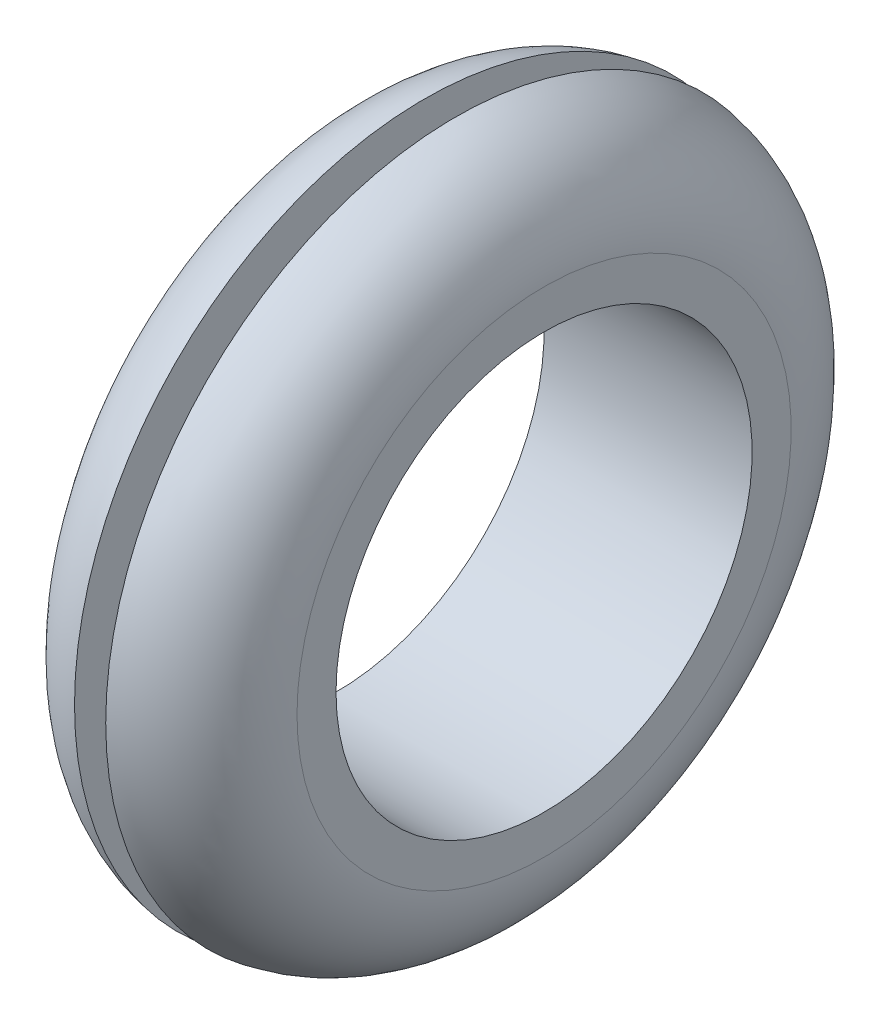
ISO-10303-21;
HEADER;
FILE_DESCRIPTION(('STEP AP214'),'2;1');
FILE_NAME('part.step','',(''),(''),'','','');
FILE_SCHEMA(('AUTOMOTIVE_DESIGN { 1 0 10303 214 1 1 1 1 }'));
ENDSEC;
DATA;
#1=APPLICATION_CONTEXT('core data for automotive mechanical design processes');
#2=APPLICATION_PROTOCOL_DEFINITION('international standard','automotive_design',2000,#1);
#3=PRODUCT_CONTEXT('',#1,'mechanical');
#4=PRODUCT('Part','Part','',(#3));
#5=PRODUCT_RELATED_PRODUCT_CATEGORY('part','',(#4));
#6=PRODUCT_DEFINITION_FORMATION('','',#4);
#7=PRODUCT_DEFINITION_CONTEXT('part definition',#1,'design');
#8=PRODUCT_DEFINITION('design','',#6,#7);
#9=PRODUCT_DEFINITION_SHAPE('','',#8);
#10=(LENGTH_UNIT() NAMED_UNIT(*) SI_UNIT(.MILLI.,.METRE.));
#11=(NAMED_UNIT(*) PLANE_ANGLE_UNIT() SI_UNIT($,.RADIAN.));
#12=(NAMED_UNIT(*) SI_UNIT($,.STERADIAN.) SOLID_ANGLE_UNIT());
#13=UNCERTAINTY_MEASURE_WITH_UNIT(LENGTH_MEASURE(1.E-05),#10,'distance_accuracy_value','');
#14=(GEOMETRIC_REPRESENTATION_CONTEXT(3) GLOBAL_UNCERTAINTY_ASSIGNED_CONTEXT((#13)) GLOBAL_UNIT_ASSIGNED_CONTEXT((#10,
#11,#12)) REPRESENTATION_CONTEXT('',''));
#15=CARTESIAN_POINT('',(0.,0.,0.));
#16=DIRECTION('',(0.,0.,1.));
#17=DIRECTION('',(1.,0.,0.));
#18=AXIS2_PLACEMENT_3D('',#15,#16,#17);
#19=CARTESIAN_POINT('',(4.,9.5,0.));
#20=DIRECTION('',(1.,0.,0.));
#21=DIRECTION('',(0.,0.,-1.));
#22=AXIS2_PLACEMENT_3D('',#19,#20,#21);
#23=PLANE('',#22);
#24=CARTESIAN_POINT('',(4.,0.,0.));
#25=DIRECTION('',(-1.,0.,0.));
#26=DIRECTION('',(0.,0.,1.));
#27=AXIS2_PLACEMENT_3D('',#24,#25,#26);
#28=CIRCLE('',#27,8.);
#29=CARTESIAN_POINT('',(4.,0.,8.));
#30=VERTEX_POINT('',#29);
#31=EDGE_CURVE('E10',#30,#30,#28,.T.);
#32=ORIENTED_EDGE('',*,*,#31,.T.);
#33=EDGE_LOOP('',(#32));
#34=FACE_BOUND('',#33,.T.);
#35=CARTESIAN_POINT('',(4.,0.,0.));
#36=DIRECTION('',(-1.,0.,0.));
#37=DIRECTION('',(0.,0.,1.));
#38=AXIS2_PLACEMENT_3D('',#35,#36,#37);
#39=CIRCLE('',#38,9.5);
#40=CARTESIAN_POINT('',(4.,0.,9.5));
#41=VERTEX_POINT('',#40);
#42=EDGE_CURVE('E61',#41,#41,#39,.T.);
#43=ORIENTED_EDGE('',*,*,#42,.F.);
#44=EDGE_LOOP('',(#43));
#45=FACE_BOUND('',#44,.T.);
#46=ADVANCED_FACE('F33',(#34,#45),#23,.T.);
#47=CARTESIAN_POINT('',(4.00125000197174,0.,0.));
#48=DIRECTION('',(-1.,0.,0.));
#49=DIRECTION('',(0.,0.,1.));
#50=AXIS2_PLACEMENT_3D('',#47,#48,#49);
#51=CYLINDRICAL_SURFACE('',#50,8.);
#52=CARTESIAN_POINT('',(-4.,0.,0.));
#53=DIRECTION('',(-1.,0.,0.));
#54=DIRECTION('',(0.,0.,1.));
#55=AXIS2_PLACEMENT_3D('',#52,#53,#54);
#56=CIRCLE('',#55,8.);
#57=CARTESIAN_POINT('',(-4.,0.,8.));
#58=VERTEX_POINT('',#57);
#59=EDGE_CURVE('E39',#58,#58,#56,.T.);
#60=ORIENTED_EDGE('',*,*,#59,.T.);
#61=EDGE_LOOP('',(#60));
#62=FACE_BOUND('',#61,.T.);
#63=ORIENTED_EDGE('',*,*,#31,.F.);
#64=EDGE_LOOP('',(#63));
#65=FACE_BOUND('',#64,.T.);
#66=ADVANCED_FACE('F69',(#62,#65),#51,.F.);
#67=CARTESIAN_POINT('',(-4.,8.,0.));
#68=DIRECTION('',(-1.,0.,0.));
#69=DIRECTION('',(0.,0.,1.));
#70=AXIS2_PLACEMENT_3D('',#67,#68,#69);
#71=PLANE('',#70);
#72=CARTESIAN_POINT('',(-4.,0.,0.));
#73=DIRECTION('',(-1.,0.,0.));
#74=DIRECTION('',(0.,0.,1.));
#75=AXIS2_PLACEMENT_3D('',#72,#73,#74);
#76=CIRCLE('',#75,9.50000000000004);
#77=CARTESIAN_POINT('',(-4.,0.,9.50000000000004));
#78=VERTEX_POINT('',#77);
#79=EDGE_CURVE('E43',#78,#78,#76,.T.);
#80=ORIENTED_EDGE('',*,*,#79,.T.);
#81=EDGE_LOOP('',(#80));
#82=FACE_BOUND('',#81,.T.);
#83=ORIENTED_EDGE('',*,*,#59,.F.);
#84=EDGE_LOOP('',(#83));
#85=FACE_BOUND('',#84,.T.);
#86=ADVANCED_FACE('F73',(#82,#85),#71,.T.);
#87=CARTESIAN_POINT('',(0.,0.,0.));
#88=DIRECTION('',(-1.,0.,0.));
#89=DIRECTION('',(0.,0.,1.));
#90=AXIS2_PLACEMENT_3D('',#87,#88,#89);
#91=TOROIDAL_SURFACE('',#90,9.5,4.);
#92=CARTESIAN_POINT('',(-0.600000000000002,0.,0.));
#93=DIRECTION('',(-1.,0.,0.));
#94=DIRECTION('',(0.,0.,1.));
#95=AXIS2_PLACEMENT_3D('',#92,#93,#94);
#96=CIRCLE('',#95,13.454743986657);
#97=CARTESIAN_POINT('',(-0.600000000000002,0.,13.454743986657));
#98=VERTEX_POINT('',#97);
#99=EDGE_CURVE('E47',#98,#98,#96,.T.);
#100=ORIENTED_EDGE('',*,*,#99,.T.);
#101=EDGE_LOOP('',(#100));
#102=FACE_BOUND('',#101,.T.);
#103=ORIENTED_EDGE('',*,*,#79,.F.);
#104=EDGE_LOOP('',(#103));
#105=FACE_BOUND('',#104,.T.);
#106=ADVANCED_FACE('F77',(#102,#105),#91,.T.);
#107=CARTESIAN_POINT('',(-0.600000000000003,13.454743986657,0.));
#108=DIRECTION('',(1.,0.,0.));
#109=DIRECTION('',(0.,0.,-1.));
#110=AXIS2_PLACEMENT_3D('',#107,#108,#109);
#111=PLANE('',#110);
#112=CARTESIAN_POINT('',(-0.600000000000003,0.,0.));
#113=DIRECTION('',(-1.,0.,0.));
#114=DIRECTION('',(0.,0.,1.));
#115=AXIS2_PLACEMENT_3D('',#112,#113,#114);
#116=CIRCLE('',#115,10.25);
#117=CARTESIAN_POINT('',(-0.600000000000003,0.,10.25));
#118=VERTEX_POINT('',#117);
#119=EDGE_CURVE('E52',#118,#118,#116,.T.);
#120=ORIENTED_EDGE('',*,*,#119,.T.);
#121=EDGE_LOOP('',(#120));
#122=FACE_BOUND('',#121,.T.);
#123=ORIENTED_EDGE('',*,*,#99,.F.);
#124=EDGE_LOOP('',(#123));
#125=FACE_BOUND('',#124,.T.);
#126=ADVANCED_FACE('F84',(#122,#125),#111,.T.);
#127=CARTESIAN_POINT('',(4.00125000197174,0.,0.));
#128=DIRECTION('',(-1.,0.,0.));
#129=DIRECTION('',(0.,0.,1.));
#130=AXIS2_PLACEMENT_3D('',#127,#128,#129);
#131=CYLINDRICAL_SURFACE('',#130,10.25);
#132=CARTESIAN_POINT('',(0.600000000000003,0.,0.));
#133=DIRECTION('',(-1.,0.,0.));
#134=DIRECTION('',(0.,0.,1.));
#135=AXIS2_PLACEMENT_3D('',#132,#133,#134);
#136=CIRCLE('',#135,10.25);
#137=CARTESIAN_POINT('',(0.600000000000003,0.,10.25));
#138=VERTEX_POINT('',#137);
#139=EDGE_CURVE('E55',#138,#138,#136,.T.);
#140=ORIENTED_EDGE('',*,*,#139,.T.);
#141=EDGE_LOOP('',(#140));
#142=FACE_BOUND('',#141,.T.);
#143=ORIENTED_EDGE('',*,*,#119,.F.);
#144=EDGE_LOOP('',(#143));
#145=FACE_BOUND('',#144,.T.);
#146=ADVANCED_FACE('F88',(#142,#145),#131,.T.);
#147=CARTESIAN_POINT('',(0.600000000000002,10.25,0.));
#148=DIRECTION('',(-1.,0.,0.));
#149=DIRECTION('',(0.,0.,1.));
#150=AXIS2_PLACEMENT_3D('',#147,#148,#149);
#151=PLANE('',#150);
#152=CARTESIAN_POINT('',(0.6,0.,0.));
#153=DIRECTION('',(-1.,0.,0.));
#154=DIRECTION('',(0.,0.,1.));
#155=AXIS2_PLACEMENT_3D('',#152,#153,#154);
#156=CIRCLE('',#155,13.454743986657);
#157=CARTESIAN_POINT('',(0.6,0.,13.454743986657));
#158=VERTEX_POINT('',#157);
#159=EDGE_CURVE('E58',#158,#158,#156,.T.);
#160=ORIENTED_EDGE('',*,*,#159,.T.);
#161=EDGE_LOOP('',(#160));
#162=FACE_BOUND('',#161,.T.);
#163=ORIENTED_EDGE('',*,*,#139,.F.);
#164=EDGE_LOOP('',(#163));
#165=FACE_BOUND('',#164,.T.);
#166=ADVANCED_FACE('F92',(#162,#165),#151,.T.);
#167=CARTESIAN_POINT('',(0.,0.,0.));
#168=DIRECTION('',(-1.,0.,0.));
#169=DIRECTION('',(0.,0.,1.));
#170=AXIS2_PLACEMENT_3D('',#167,#168,#169);
#171=TOROIDAL_SURFACE('',#170,9.5,4.);
#172=ORIENTED_EDGE('',*,*,#42,.T.);
#173=EDGE_LOOP('',(#172));
#174=FACE_BOUND('',#173,.T.);
#175=ORIENTED_EDGE('',*,*,#159,.F.);
#176=EDGE_LOOP('',(#175));
#177=FACE_BOUND('',#176,.T.);
#178=ADVANCED_FACE('F65',(#174,#177),#171,.T.);
#179=CLOSED_SHELL('',(#46,#66,#86,#106,#126,#146,#166,#178));
#180=MANIFOLD_SOLID_BREP('B2',#179);
#181=ADVANCED_BREP_SHAPE_REPRESENTATION('',(#18,#180),#14);
#182=SHAPE_DEFINITION_REPRESENTATION(#9,#181);
ENDSEC;
END-ISO-10303-21;
